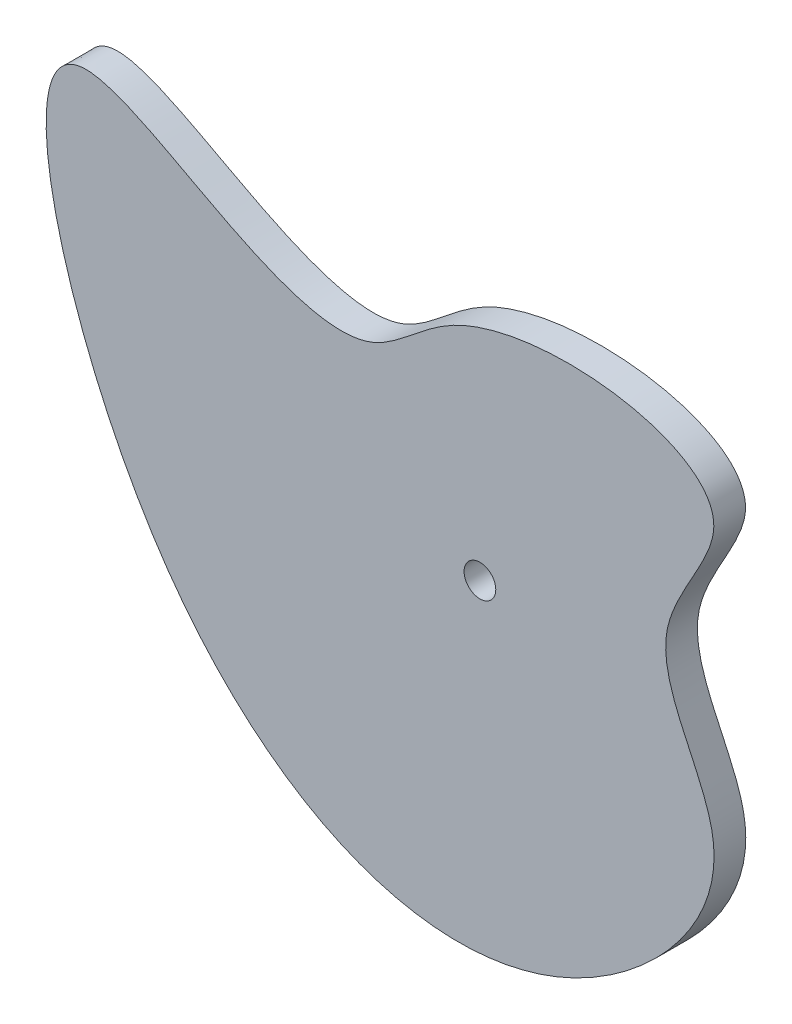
from build123d import *

# Parameters (mm, degrees)
SKETCH1_R           = 1.5875
BOSS_EXTRUDE1_DEPTH = 3.175


with BuildPart() as part:
    # Sketch1 → Boss-Extrude1 (new body)
    with BuildSketch(Plane.XY):
        with BuildLine():
            add(Edge.make_bspline(
                [(-2.662641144, 20.815313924), (-6.026770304, 19.033728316), (-14.666349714, 7.804808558), (-52.235267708, 41.901577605), (-34.972989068, -26.098799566), (5.306038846, -39.786823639), (28.932863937, -12.220888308), (14.194753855, 3.422195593), (31.757487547, 22.091623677), (6.230175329, 25.524798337), (-2.662641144, 20.815313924)],
                knots=[0, 0, 0, 0, 0.049567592, 0.199465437, 0.394943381, 0.620576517, 0.727085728, 0.807748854, 0.868971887, 1, 1, 1, 1], degree=3))
        make_face()
        Circle(SKETCH1_R, mode=Mode.SUBTRACT)
    extrude(amount=BOSS_EXTRUDE1_DEPTH)


solid = part.part
